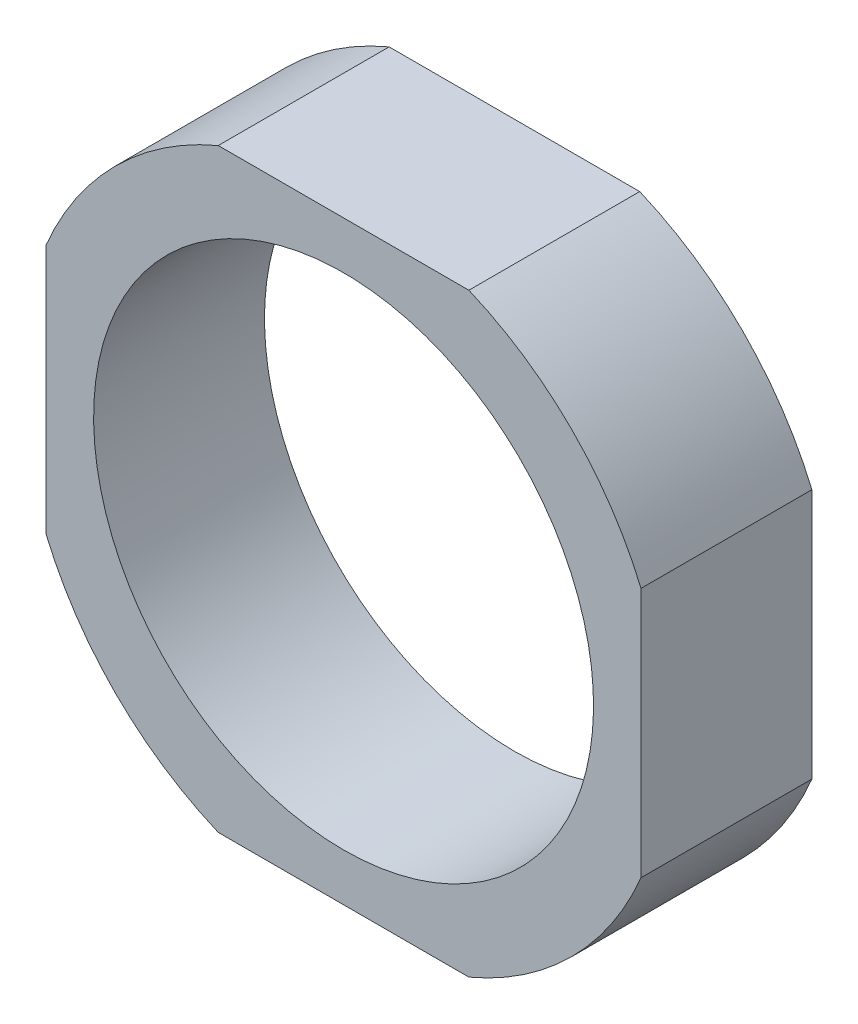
ISO-10303-21;
HEADER;
FILE_DESCRIPTION(('STEP AP214'),'2;1');
FILE_NAME('part.step','',(''),(''),'','','');
FILE_SCHEMA(('AUTOMOTIVE_DESIGN { 1 0 10303 214 1 1 1 1 }'));
ENDSEC;
DATA;
#1=APPLICATION_CONTEXT('core data for automotive mechanical design processes');
#2=APPLICATION_PROTOCOL_DEFINITION('international standard','automotive_design',2000,#1);
#3=PRODUCT_CONTEXT('',#1,'mechanical');
#4=PRODUCT('Part','Part','',(#3));
#5=PRODUCT_RELATED_PRODUCT_CATEGORY('part','',(#4));
#6=PRODUCT_DEFINITION_FORMATION('','',#4);
#7=PRODUCT_DEFINITION_CONTEXT('part definition',#1,'design');
#8=PRODUCT_DEFINITION('design','',#6,#7);
#9=PRODUCT_DEFINITION_SHAPE('','',#8);
#10=(LENGTH_UNIT() NAMED_UNIT(*) SI_UNIT(.MILLI.,.METRE.));
#11=(NAMED_UNIT(*) PLANE_ANGLE_UNIT() SI_UNIT($,.RADIAN.));
#12=(NAMED_UNIT(*) SI_UNIT($,.STERADIAN.) SOLID_ANGLE_UNIT());
#13=UNCERTAINTY_MEASURE_WITH_UNIT(LENGTH_MEASURE(1.E-05),#10,'distance_accuracy_value','');
#14=(GEOMETRIC_REPRESENTATION_CONTEXT(3) GLOBAL_UNCERTAINTY_ASSIGNED_CONTEXT((#13)) GLOBAL_UNIT_ASSIGNED_CONTEXT((#10,
#11,#12)) REPRESENTATION_CONTEXT('',''));
#15=CARTESIAN_POINT('',(0.,0.,0.));
#16=DIRECTION('',(0.,0.,1.));
#17=DIRECTION('',(1.,0.,0.));
#18=AXIS2_PLACEMENT_3D('',#15,#16,#17);
#19=CARTESIAN_POINT('',(19.798989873,-47.,0.));
#20=DIRECTION('',(0.,1.,0.));
#21=DIRECTION('',(-1.,0.,0.));
#22=AXIS2_PLACEMENT_3D('',#19,#20,#21);
#23=PLANE('',#22);
#24=DIRECTION('',(1.,0.,0.));
#25=VECTOR('',#24,1.);
#26=CARTESIAN_POINT('',(0.,-47.,27.));
#27=LINE('',#26,#25);
#28=CARTESIAN_POINT('',(-19.7989898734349,-46.9999999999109,27.));
#29=VERTEX_POINT('',#28);
#30=CARTESIAN_POINT('',(19.7989898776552,-46.9999999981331,27.));
#31=VERTEX_POINT('',#30);
#32=EDGE_CURVE('E120',#29,#31,#27,.T.);
#33=ORIENTED_EDGE('',*,*,#32,.F.);
#34=DIRECTION('',(0.,0.,1.));
#35=VECTOR('',#34,1.);
#36=CARTESIAN_POINT('',(-19.7989898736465,-46.9999999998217,13.5));
#37=LINE('',#36,#35);
#38=CARTESIAN_POINT('',(-19.7989898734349,-46.9999999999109,0.));
#39=VERTEX_POINT('',#38);
#40=EDGE_CURVE('E105',#29,#39,#37,.F.);
#41=ORIENTED_EDGE('',*,*,#40,.T.);
#42=DIRECTION('',(1.,0.,0.));
#43=VECTOR('',#42,1.);
#44=CARTESIAN_POINT('',(0.,-47.,0.));
#45=LINE('',#44,#43);
#46=CARTESIAN_POINT('',(19.7989898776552,-46.9999999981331,0.));
#47=VERTEX_POINT('',#46);
#48=EDGE_CURVE('E143',#39,#47,#45,.T.);
#49=ORIENTED_EDGE('',*,*,#48,.T.);
#50=DIRECTION('',(0.,0.,-1.));
#51=VECTOR('',#50,1.);
#52=CARTESIAN_POINT('',(19.798989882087,-46.9999999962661,13.5));
#53=LINE('',#52,#51);
#54=EDGE_CURVE('E132',#47,#31,#53,.F.);
#55=ORIENTED_EDGE('',*,*,#54,.T.);
#56=EDGE_LOOP('',(#33,#41,#49,#55));
#57=FACE_BOUND('',#56,.T.);
#58=ADVANCED_FACE('F14',(#57),#23,.F.);
#59=CARTESIAN_POINT('',(0.,0.,27.));
#60=DIRECTION('',(0.,0.,-1.));
#61=DIRECTION('',(1.,0.,0.));
#62=AXIS2_PLACEMENT_3D('',#59,#60,#61);
#63=CYLINDRICAL_SURFACE('',#62,51.);
#64=ORIENTED_EDGE('',*,*,#54,.F.);
#65=CARTESIAN_POINT('',(0.,0.,0.));
#66=DIRECTION('',(0.,0.,-1.));
#67=DIRECTION('',(1.,0.,0.));
#68=AXIS2_PLACEMENT_3D('',#65,#66,#67);
#69=CIRCLE('',#68,51.);
#70=CARTESIAN_POINT('',(47.,-19.7989898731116,0.));
#71=VERTEX_POINT('',#70);
#72=EDGE_CURVE('E122',#47,#71,#69,.F.);
#73=ORIENTED_EDGE('',*,*,#72,.T.);
#74=DIRECTION('',(0.,0.,1.));
#75=VECTOR('',#74,1.);
#76=CARTESIAN_POINT('',(47.,-19.798989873,13.5));
#77=LINE('',#76,#75);
#78=CARTESIAN_POINT('',(47.,-19.7989898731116,27.));
#79=VERTEX_POINT('',#78);
#80=EDGE_CURVE('E129',#71,#79,#77,.T.);
#81=ORIENTED_EDGE('',*,*,#80,.T.);
#82=CARTESIAN_POINT('',(0.,0.,27.));
#83=DIRECTION('',(0.,0.,-1.));
#84=DIRECTION('',(1.,0.,0.));
#85=AXIS2_PLACEMENT_3D('',#82,#83,#84);
#86=CIRCLE('',#85,51.);
#87=EDGE_CURVE('E119',#31,#79,#86,.F.);
#88=ORIENTED_EDGE('',*,*,#87,.F.);
#89=EDGE_LOOP('',(#64,#73,#81,#88));
#90=FACE_BOUND('',#89,.T.);
#91=ADVANCED_FACE('F166',(#90),#63,.T.);
#92=CARTESIAN_POINT('',(47.,19.798989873,0.));
#93=DIRECTION('',(-1.,0.,0.));
#94=DIRECTION('',(0.,-1.,0.));
#95=AXIS2_PLACEMENT_3D('',#92,#93,#94);
#96=PLANE('',#95);
#97=DIRECTION('',(0.,1.,0.));
#98=VECTOR('',#97,1.);
#99=CARTESIAN_POINT('',(47.,0.,27.));
#100=LINE('',#99,#98);
#101=CARTESIAN_POINT('',(46.9999999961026,19.7989898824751,27.));
#102=VERTEX_POINT('',#101);
#103=EDGE_CURVE('E117',#79,#102,#100,.T.);
#104=ORIENTED_EDGE('',*,*,#103,.F.);
#105=ORIENTED_EDGE('',*,*,#80,.F.);
#106=DIRECTION('',(0.,1.,0.));
#107=VECTOR('',#106,1.);
#108=CARTESIAN_POINT('',(47.,0.,0.));
#109=LINE('',#108,#107);
#110=CARTESIAN_POINT('',(46.9999999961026,19.7989898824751,0.));
#111=VERTEX_POINT('',#110);
#112=EDGE_CURVE('E104',#71,#111,#109,.T.);
#113=ORIENTED_EDGE('',*,*,#112,.T.);
#114=DIRECTION('',(0.,0.,-1.));
#115=VECTOR('',#114,1.);
#116=CARTESIAN_POINT('',(46.9999999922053,19.7989898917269,13.5));
#117=LINE('',#116,#115);
#118=EDGE_CURVE('E78',#111,#102,#117,.F.);
#119=ORIENTED_EDGE('',*,*,#118,.T.);
#120=EDGE_LOOP('',(#104,#105,#113,#119));
#121=FACE_BOUND('',#120,.T.);
#122=ADVANCED_FACE('F164',(#121),#96,.F.);
#123=CARTESIAN_POINT('',(0.,0.,27.));
#124=DIRECTION('',(0.,0.,-1.));
#125=DIRECTION('',(1.,0.,0.));
#126=AXIS2_PLACEMENT_3D('',#123,#124,#125);
#127=CYLINDRICAL_SURFACE('',#126,51.);
#128=ORIENTED_EDGE('',*,*,#118,.F.);
#129=CARTESIAN_POINT('',(0.,0.,0.));
#130=DIRECTION('',(0.,0.,-1.));
#131=DIRECTION('',(1.,0.,0.));
#132=AXIS2_PLACEMENT_3D('',#129,#130,#131);
#133=CIRCLE('',#132,51.);
#134=CARTESIAN_POINT('',(19.7989898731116,47.,0.));
#135=VERTEX_POINT('',#134);
#136=EDGE_CURVE('E18',#111,#135,#133,.F.);
#137=ORIENTED_EDGE('',*,*,#136,.T.);
#138=DIRECTION('',(0.,0.,1.));
#139=VECTOR('',#138,1.);
#140=CARTESIAN_POINT('',(19.798989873,47.,13.5));
#141=LINE('',#140,#139);
#142=CARTESIAN_POINT('',(19.7989898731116,47.,27.));
#143=VERTEX_POINT('',#142);
#144=EDGE_CURVE('E85',#135,#143,#141,.T.);
#145=ORIENTED_EDGE('',*,*,#144,.T.);
#146=CARTESIAN_POINT('',(0.,0.,27.));
#147=DIRECTION('',(0.,0.,-1.));
#148=DIRECTION('',(1.,0.,0.));
#149=AXIS2_PLACEMENT_3D('',#146,#147,#148);
#150=CIRCLE('',#149,51.);
#151=EDGE_CURVE('E116',#102,#143,#150,.F.);
#152=ORIENTED_EDGE('',*,*,#151,.F.);
#153=EDGE_LOOP('',(#128,#137,#145,#152));
#154=FACE_BOUND('',#153,.T.);
#155=ADVANCED_FACE('F103',(#154),#127,.T.);
#156=CARTESIAN_POINT('',(-19.798989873,47.,0.));
#157=DIRECTION('',(0.,-1.,0.));
#158=DIRECTION('',(1.,0.,0.));
#159=AXIS2_PLACEMENT_3D('',#156,#157,#158);
#160=PLANE('',#159);
#161=DIRECTION('',(-1.,0.,0.));
#162=VECTOR('',#161,1.);
#163=CARTESIAN_POINT('',(0.,47.,27.));
#164=LINE('',#163,#162);
#165=CARTESIAN_POINT('',(-19.7989898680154,47.0000000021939,27.));
#166=VERTEX_POINT('',#165);
#167=EDGE_CURVE('E90',#143,#166,#164,.T.);
#168=ORIENTED_EDGE('',*,*,#167,.F.);
#169=ORIENTED_EDGE('',*,*,#144,.F.);
#170=DIRECTION('',(-1.,0.,0.));
#171=VECTOR('',#170,1.);
#172=CARTESIAN_POINT('',(0.,47.,0.));
#173=LINE('',#172,#171);
#174=CARTESIAN_POINT('',(-19.7989898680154,47.0000000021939,0.));
#175=VERTEX_POINT('',#174);
#176=EDGE_CURVE('E89',#135,#175,#173,.T.);
#177=ORIENTED_EDGE('',*,*,#176,.T.);
#178=DIRECTION('',(0.,0.,-1.));
#179=VECTOR('',#178,1.);
#180=CARTESIAN_POINT('',(-19.7989898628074,47.0000000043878,13.5));
#181=LINE('',#180,#179);
#182=EDGE_CURVE('E91',#175,#166,#181,.F.);
#183=ORIENTED_EDGE('',*,*,#182,.T.);
#184=EDGE_LOOP('',(#168,#169,#177,#183));
#185=FACE_BOUND('',#184,.T.);
#186=ADVANCED_FACE('F87',(#185),#160,.F.);
#187=CARTESIAN_POINT('',(0.,0.,27.));
#188=DIRECTION('',(0.,0.,-1.));
#189=DIRECTION('',(1.,0.,0.));
#190=AXIS2_PLACEMENT_3D('',#187,#188,#189);
#191=CYLINDRICAL_SURFACE('',#190,51.);
#192=ORIENTED_EDGE('',*,*,#182,.F.);
#193=CARTESIAN_POINT('',(0.,0.,0.));
#194=DIRECTION('',(0.,0.,-1.));
#195=DIRECTION('',(1.,0.,0.));
#196=AXIS2_PLACEMENT_3D('',#193,#194,#195);
#197=CIRCLE('',#196,51.);
#198=CARTESIAN_POINT('',(-47.,19.7989898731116,0.));
#199=VERTEX_POINT('',#198);
#200=EDGE_CURVE('E101',#175,#199,#197,.F.);
#201=ORIENTED_EDGE('',*,*,#200,.T.);
#202=DIRECTION('',(0.,0.,1.));
#203=VECTOR('',#202,1.);
#204=CARTESIAN_POINT('',(-47.,19.798989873,13.5));
#205=LINE('',#204,#203);
#206=CARTESIAN_POINT('',(-47.,19.7989898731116,27.));
#207=VERTEX_POINT('',#206);
#208=EDGE_CURVE('E123',#199,#207,#205,.T.);
#209=ORIENTED_EDGE('',*,*,#208,.T.);
#210=CARTESIAN_POINT('',(0.,0.,27.));
#211=DIRECTION('',(0.,0.,-1.));
#212=DIRECTION('',(1.,0.,0.));
#213=AXIS2_PLACEMENT_3D('',#210,#211,#212);
#214=CIRCLE('',#213,51.);
#215=EDGE_CURVE('E114',#166,#207,#214,.F.);
#216=ORIENTED_EDGE('',*,*,#215,.F.);
#217=EDGE_LOOP('',(#192,#201,#209,#216));
#218=FACE_BOUND('',#217,.T.);
#219=ADVANCED_FACE('F162',(#218),#191,.T.);
#220=CARTESIAN_POINT('',(-47.,-19.798989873,0.));
#221=DIRECTION('',(1.,0.,0.));
#222=DIRECTION('',(0.,1.,0.));
#223=AXIS2_PLACEMENT_3D('',#220,#221,#222);
#224=PLANE('',#223);
#225=DIRECTION('',(0.,-1.,0.));
#226=VECTOR('',#225,1.);
#227=CARTESIAN_POINT('',(-47.,0.,27.));
#228=LINE('',#227,#226);
#229=CARTESIAN_POINT('',(-47.0000000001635,-19.7989898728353,27.));
#230=VERTEX_POINT('',#229);
#231=EDGE_CURVE('E33',#207,#230,#228,.T.);
#232=ORIENTED_EDGE('',*,*,#231,.F.);
#233=ORIENTED_EDGE('',*,*,#208,.F.);
#234=DIRECTION('',(0.,-1.,0.));
#235=VECTOR('',#234,1.);
#236=CARTESIAN_POINT('',(-47.,0.,0.));
#237=LINE('',#236,#235);
#238=CARTESIAN_POINT('',(-47.0000000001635,-19.7989898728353,0.));
#239=VERTEX_POINT('',#238);
#240=EDGE_CURVE('E146',#199,#239,#237,.T.);
#241=ORIENTED_EDGE('',*,*,#240,.T.);
#242=DIRECTION('',(0.,0.,-1.));
#243=VECTOR('',#242,1.);
#244=CARTESIAN_POINT('',(-47.000000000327,-19.7989898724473,13.5));
#245=LINE('',#244,#243);
#246=EDGE_CURVE('E108',#239,#230,#245,.F.);
#247=ORIENTED_EDGE('',*,*,#246,.T.);
#248=EDGE_LOOP('',(#232,#233,#241,#247));
#249=FACE_BOUND('',#248,.T.);
#250=ADVANCED_FACE('F160',(#249),#224,.F.);
#251=CARTESIAN_POINT('',(0.,0.,27.));
#252=DIRECTION('',(0.,0.,-1.));
#253=DIRECTION('',(1.,0.,0.));
#254=AXIS2_PLACEMENT_3D('',#251,#252,#253);
#255=CYLINDRICAL_SURFACE('',#254,51.);
#256=ORIENTED_EDGE('',*,*,#40,.F.);
#257=CARTESIAN_POINT('',(0.,0.,27.));
#258=DIRECTION('',(0.,0.,-1.));
#259=DIRECTION('',(1.,0.,0.));
#260=AXIS2_PLACEMENT_3D('',#257,#258,#259);
#261=CIRCLE('',#260,51.);
#262=EDGE_CURVE('E113',#230,#29,#261,.F.);
#263=ORIENTED_EDGE('',*,*,#262,.F.);
#264=ORIENTED_EDGE('',*,*,#246,.F.);
#265=CARTESIAN_POINT('',(0.,0.,0.));
#266=DIRECTION('',(0.,0.,-1.));
#267=DIRECTION('',(1.,0.,0.));
#268=AXIS2_PLACEMENT_3D('',#265,#266,#267);
#269=CIRCLE('',#268,51.);
#270=EDGE_CURVE('E144',#239,#39,#269,.F.);
#271=ORIENTED_EDGE('',*,*,#270,.T.);
#272=EDGE_LOOP('',(#256,#263,#264,#271));
#273=FACE_BOUND('',#272,.T.);
#274=ADVANCED_FACE('F158',(#273),#255,.T.);
#275=CARTESIAN_POINT('',(-47.,47.,0.));
#276=DIRECTION('',(0.,0.,1.));
#277=DIRECTION('',(0.,-1.,0.));
#278=AXIS2_PLACEMENT_3D('',#275,#276,#277);
#279=PLANE('',#278);
#280=CARTESIAN_POINT('',(0.,0.,0.));
#281=DIRECTION('',(0.,0.,1.));
#282=DIRECTION('',(0.,-1.,0.));
#283=AXIS2_PLACEMENT_3D('',#280,#281,#282);
#284=CIRCLE('',#283,39.5);
#285=CARTESIAN_POINT('',(0.,-39.5,0.));
#286=VERTEX_POINT('',#285);
#287=EDGE_CURVE('E24',#286,#286,#284,.F.);
#288=ORIENTED_EDGE('',*,*,#287,.F.);
#289=EDGE_LOOP('',(#288));
#290=FACE_BOUND('',#289,.T.);
#291=ORIENTED_EDGE('',*,*,#48,.F.);
#292=ORIENTED_EDGE('',*,*,#270,.F.);
#293=ORIENTED_EDGE('',*,*,#240,.F.);
#294=ORIENTED_EDGE('',*,*,#200,.F.);
#295=ORIENTED_EDGE('',*,*,#176,.F.);
#296=ORIENTED_EDGE('',*,*,#136,.F.);
#297=ORIENTED_EDGE('',*,*,#112,.F.);
#298=ORIENTED_EDGE('',*,*,#72,.F.);
#299=EDGE_LOOP('',(#291,#292,#293,#294,#295,#296,#297,#298));
#300=FACE_BOUND('',#299,.T.);
#301=ADVANCED_FACE('F96',(#290,#300),#279,.F.);
#302=CARTESIAN_POINT('',(-47.,47.,27.));
#303=DIRECTION('',(0.,0.,1.));
#304=DIRECTION('',(0.,-1.,0.));
#305=AXIS2_PLACEMENT_3D('',#302,#303,#304);
#306=PLANE('',#305);
#307=CARTESIAN_POINT('',(0.,0.,27.));
#308=DIRECTION('',(0.,0.,1.));
#309=DIRECTION('',(0.,-1.,0.));
#310=AXIS2_PLACEMENT_3D('',#307,#308,#309);
#311=CIRCLE('',#310,39.5);
#312=CARTESIAN_POINT('',(0.,-39.5,27.));
#313=VERTEX_POINT('',#312);
#314=EDGE_CURVE('E9',#313,#313,#311,.T.);
#315=ORIENTED_EDGE('',*,*,#314,.F.);
#316=EDGE_LOOP('',(#315));
#317=FACE_BOUND('',#316,.T.);
#318=ORIENTED_EDGE('',*,*,#231,.T.);
#319=ORIENTED_EDGE('',*,*,#262,.T.);
#320=ORIENTED_EDGE('',*,*,#32,.T.);
#321=ORIENTED_EDGE('',*,*,#87,.T.);
#322=ORIENTED_EDGE('',*,*,#103,.T.);
#323=ORIENTED_EDGE('',*,*,#151,.T.);
#324=ORIENTED_EDGE('',*,*,#167,.T.);
#325=ORIENTED_EDGE('',*,*,#215,.T.);
#326=EDGE_LOOP('',(#318,#319,#320,#321,#322,#323,#324,#325));
#327=FACE_BOUND('',#326,.T.);
#328=ADVANCED_FACE('F16',(#317,#327),#306,.T.);
#329=CARTESIAN_POINT('',(0.,0.,0.));
#330=DIRECTION('',(0.,0.,1.));
#331=DIRECTION('',(0.,-1.,0.));
#332=AXIS2_PLACEMENT_3D('',#329,#330,#331);
#333=CYLINDRICAL_SURFACE('',#332,39.5);
#334=ORIENTED_EDGE('',*,*,#314,.T.);
#335=EDGE_LOOP('',(#334));
#336=FACE_BOUND('',#335,.T.);
#337=ORIENTED_EDGE('',*,*,#287,.T.);
#338=EDGE_LOOP('',(#337));
#339=FACE_BOUND('',#338,.T.);
#340=ADVANCED_FACE('F179',(#336,#339),#333,.F.);
#341=CLOSED_SHELL('',(#58,#91,#122,#155,#186,#219,#250,#274,#301,#328,#340));
#342=MANIFOLD_SOLID_BREP('B1',#341);
#343=ADVANCED_BREP_SHAPE_REPRESENTATION('',(#18,#342),#14);
#344=SHAPE_DEFINITION_REPRESENTATION(#9,#343);
ENDSEC;
END-ISO-10303-21;
